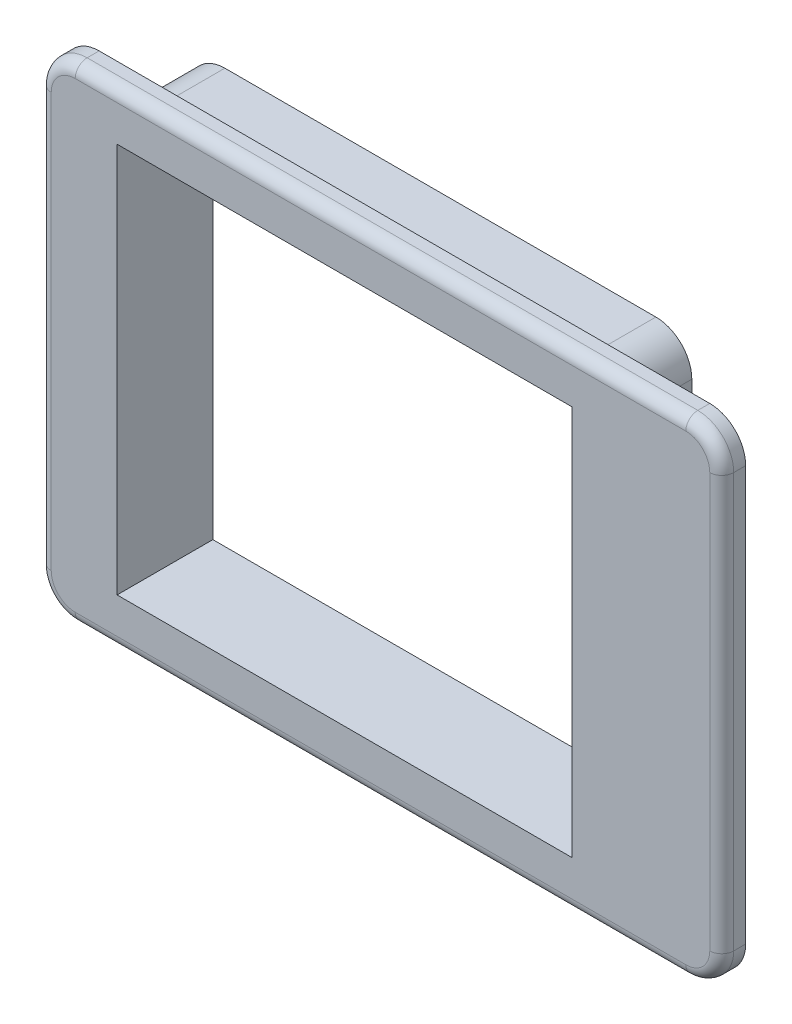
from build123d import *

# Parameters (mm, degrees)
SKETCH1_W           = 38
SKETCH1_H           = 32.6
BOSS_EXTRUDE1_DEPTH = 6
SKETCH2_W           = 38
SKETCH2_H           = 32.6
BOSS_EXTRUDE2_DEPTH = 2
FILLET1_R           = 1


with BuildPart() as part:
    # Sketch1 → Boss-Extrude1 (new body)
    with BuildSketch(Plane.XY):
        with BuildLine():
            Line((1, 34.6), (37, 34.6))
            ThreePointArc((37, 34.6), (39.121320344, 33.721320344), (40, 31.6))
            Line((40, 31.6), (40, 1))
            ThreePointArc((40, 1), (39.121320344, -1.121320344), (37, -2))
            Line((37, -2), (1, -2))
            ThreePointArc((1, -2), (-1.121320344, -1.121320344), (-2, 1))
            Line((-2, 1), (-2, 31.6))
            ThreePointArc((-2, 31.6), (-1.121320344, 33.721320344), (1, 34.6))
        make_face()
        with Locations((19, 16.3)):
            Rectangle(SKETCH1_W, SKETCH1_H, mode=Mode.SUBTRACT)
    extrude(amount=BOSS_EXTRUDE1_DEPTH)

    # Sketch2 → Boss-Extrude2 (add)
    with BuildSketch(Plane.XY.offset(6)):
        with BuildLine():
            Line((-3.5, 36.6), (47.5, 36.6))
            ThreePointArc((47.5, 36.6), (49.621320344, 35.721320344), (50.5, 33.6))
            Line((50.5, 33.6), (50.5, -1))
            ThreePointArc((50.5, -1), (49.621320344, -3.121320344), (47.5, -4))
            Line((47.5, -4), (-3.5, -4))
            ThreePointArc((-3.5, -4), (-5.621320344, -3.121320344), (-6.5, -1))
            Line((-6.5, -1), (-6.5, 33.6))
            ThreePointArc((-6.5, 33.6), (-5.621320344, 35.721320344), (-3.5, 36.6))
        make_face()
        with Locations((19, 16.3)):
            Rectangle(SKETCH2_W, SKETCH2_H, mode=Mode.SUBTRACT)
    extrude(amount=BOSS_EXTRUDE2_DEPTH)

    # Fillet1
    fillet1_edges = [part.edges().sort_by_distance(p)[0] for p in [
        (-5.621320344, -3.121320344, 8),
        (22, -4, 8),
        (49.621320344, -3.121320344, 8),
        (50.5, 16.3, 8),
        (49.621320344, 35.721320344, 8),
        (22, 36.6, 8),
        (-5.621320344, 35.721320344, 8),
        (-6.5, 16.3, 8),
    ]]
    fillet(fillet1_edges, radius=FILLET1_R)


solid = part.part
